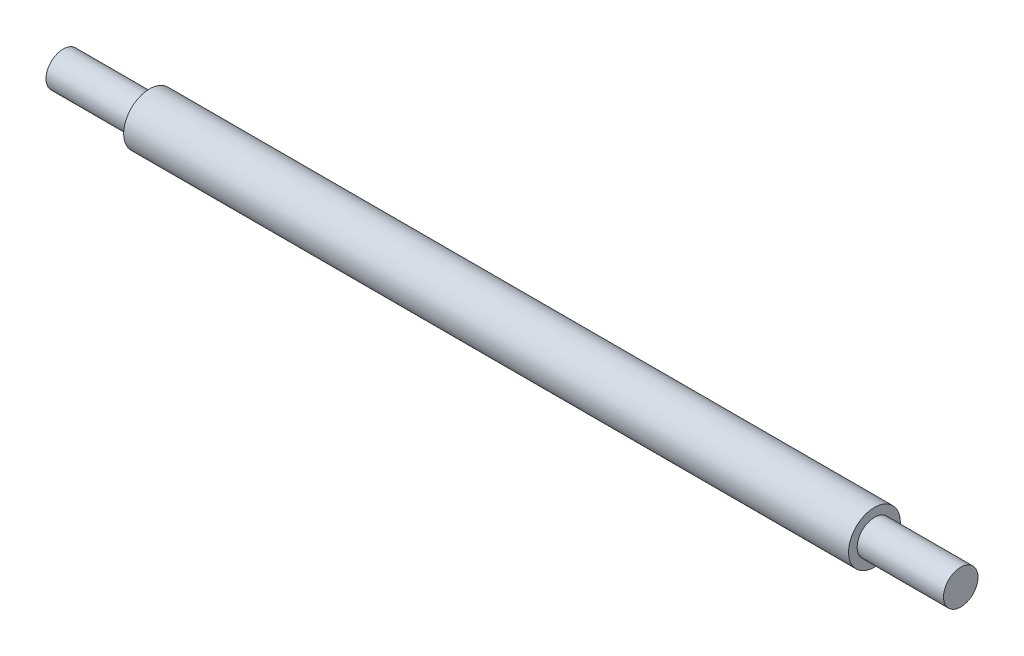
from build123d import *


with BuildPart() as part:
    # Sketch1 → Revolve1 (revolve)
    with BuildSketch(Plane.XY, mode=Mode.PRIVATE) as revolve1_sk:
        Polygon((-52, 0), (-52, 2), (-42, 2), (-42, 3), (42, 3), (42, 2), (52, 2), (52, 0), align=None)
    revolve(revolve1_sk.sketch.rotate(Axis((-52, 0, 0), (1, 0, 0)), 180), axis=Axis((-52, 0, 0), (1, 0, 0)))


solid = part.part
